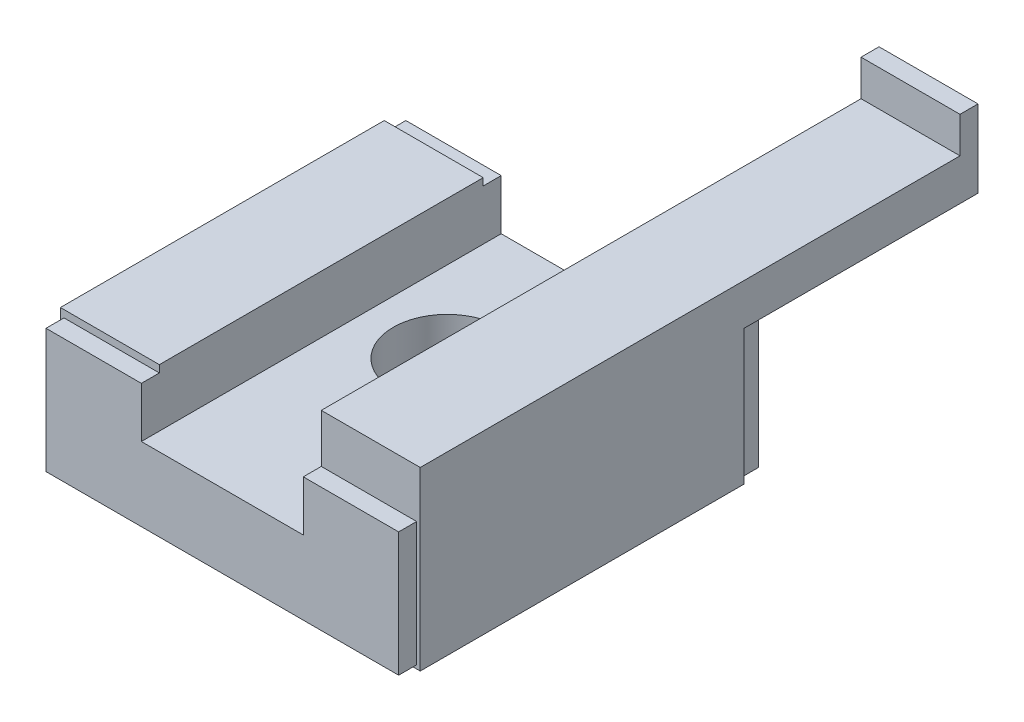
ISO-10303-21;
HEADER;
FILE_DESCRIPTION(('STEP AP214'),'2;1');
FILE_NAME('part.step','',(''),(''),'','','');
FILE_SCHEMA(('AUTOMOTIVE_DESIGN { 1 0 10303 214 1 1 1 1 }'));
ENDSEC;
DATA;
#1=APPLICATION_CONTEXT('core data for automotive mechanical design processes');
#2=APPLICATION_PROTOCOL_DEFINITION('international standard','automotive_design',2000,#1);
#3=PRODUCT_CONTEXT('',#1,'mechanical');
#4=PRODUCT('Part','Part','',(#3));
#5=PRODUCT_RELATED_PRODUCT_CATEGORY('part','',(#4));
#6=PRODUCT_DEFINITION_FORMATION('','',#4);
#7=PRODUCT_DEFINITION_CONTEXT('part definition',#1,'design');
#8=PRODUCT_DEFINITION('design','',#6,#7);
#9=PRODUCT_DEFINITION_SHAPE('','',#8);
#10=(LENGTH_UNIT() NAMED_UNIT(*) SI_UNIT(.MILLI.,.METRE.));
#11=(NAMED_UNIT(*) PLANE_ANGLE_UNIT() SI_UNIT($,.RADIAN.));
#12=(NAMED_UNIT(*) SI_UNIT($,.STERADIAN.) SOLID_ANGLE_UNIT());
#13=UNCERTAINTY_MEASURE_WITH_UNIT(LENGTH_MEASURE(1.E-05),#10,'distance_accuracy_value','');
#14=(GEOMETRIC_REPRESENTATION_CONTEXT(3) GLOBAL_UNCERTAINTY_ASSIGNED_CONTEXT((#13)) GLOBAL_UNIT_ASSIGNED_CONTEXT((#10,
#11,#12)) REPRESENTATION_CONTEXT('',''));
#15=CARTESIAN_POINT('',(0.,0.,0.));
#16=DIRECTION('',(0.,0.,1.));
#17=DIRECTION('',(1.,0.,0.));
#18=AXIS2_PLACEMENT_3D('',#15,#16,#17);
#19=CARTESIAN_POINT('',(4.5,9.8,19.));
#20=DIRECTION('',(0.,1.,0.));
#21=DIRECTION('',(1.,0.,0.));
#22=AXIS2_PLACEMENT_3D('',#19,#20,#21);
#23=PLANE('',#22);
#24=DIRECTION('',(-1.,0.,0.));
#25=VECTOR('',#24,1.);
#26=CARTESIAN_POINT('',(10.,9.8,-11.));
#27=LINE('',#26,#25);
#28=CARTESIAN_POINT('',(4.5,9.8,-11.));
#29=VERTEX_POINT('',#28);
#30=CARTESIAN_POINT('',(10.,9.8,-11.));
#31=VERTEX_POINT('',#30);
#32=EDGE_CURVE('E197',#29,#31,#27,.F.);
#33=ORIENTED_EDGE('',*,*,#32,.F.);
#34=DIRECTION('',(0.,0.,1.));
#35=VECTOR('',#34,1.);
#36=CARTESIAN_POINT('',(4.5,9.8,-11.));
#37=LINE('',#36,#35);
#38=CARTESIAN_POINT('',(4.5,9.8,19.));
#39=VERTEX_POINT('',#38);
#40=EDGE_CURVE('E212',#39,#29,#37,.F.);
#41=ORIENTED_EDGE('',*,*,#40,.F.);
#42=DIRECTION('',(1.,0.,0.));
#43=VECTOR('',#42,1.);
#44=CARTESIAN_POINT('',(4.5,9.8,19.));
#45=LINE('',#44,#43);
#46=CARTESIAN_POINT('',(10.,9.8,19.));
#47=VERTEX_POINT('',#46);
#48=EDGE_CURVE('E221',#47,#39,#45,.F.);
#49=ORIENTED_EDGE('',*,*,#48,.F.);
#50=DIRECTION('',(0.,0.,-1.));
#51=VECTOR('',#50,1.);
#52=CARTESIAN_POINT('',(10.,9.8,19.));
#53=LINE('',#52,#51);
#54=EDGE_CURVE('E214',#47,#31,#53,.T.);
#55=ORIENTED_EDGE('',*,*,#54,.T.);
#56=EDGE_LOOP('',(#33,#41,#49,#55));
#57=FACE_BOUND('',#56,.T.);
#58=ADVANCED_FACE('F16',(#57),#23,.T.);
#59=CARTESIAN_POINT('',(-10.,7.5,19.));
#60=DIRECTION('',(0.,1.,0.));
#61=DIRECTION('',(1.,0.,0.));
#62=AXIS2_PLACEMENT_3D('',#59,#60,#61);
#63=PLANE('',#62);
#64=DIRECTION('',(1.,0.,0.));
#65=VECTOR('',#64,1.);
#66=CARTESIAN_POINT('',(-10.,7.5,19.));
#67=LINE('',#66,#65);
#68=CARTESIAN_POINT('',(-4.5,7.5,19.));
#69=VERTEX_POINT('',#68);
#70=CARTESIAN_POINT('',(-10.,7.5,19.));
#71=VERTEX_POINT('',#70);
#72=EDGE_CURVE('E232',#69,#71,#67,.F.);
#73=ORIENTED_EDGE('',*,*,#72,.F.);
#74=DIRECTION('',(0.,0.,-1.));
#75=VECTOR('',#74,1.);
#76=CARTESIAN_POINT('',(-4.5,7.5,19.));
#77=LINE('',#76,#75);
#78=CARTESIAN_POINT('',(-4.5,7.5,1.));
#79=VERTEX_POINT('',#78);
#80=EDGE_CURVE('E236',#69,#79,#77,.T.);
#81=ORIENTED_EDGE('',*,*,#80,.T.);
#82=DIRECTION('',(-1.,0.,0.));
#83=VECTOR('',#82,1.);
#84=CARTESIAN_POINT('',(-4.5,7.5,1.));
#85=LINE('',#84,#83);
#86=CARTESIAN_POINT('',(-10.,7.5,1.));
#87=VERTEX_POINT('',#86);
#88=EDGE_CURVE('E241',#79,#87,#85,.T.);
#89=ORIENTED_EDGE('',*,*,#88,.T.);
#90=DIRECTION('',(0.,0.,1.));
#91=VECTOR('',#90,1.);
#92=CARTESIAN_POINT('',(-10.,7.5,1.));
#93=LINE('',#92,#91);
#94=EDGE_CURVE('E246',#71,#87,#93,.F.);
#95=ORIENTED_EDGE('',*,*,#94,.F.);
#96=EDGE_LOOP('',(#73,#81,#89,#95));
#97=FACE_BOUND('',#96,.T.);
#98=ADVANCED_FACE('F620',(#97),#63,.T.);
#99=CARTESIAN_POINT('',(-10.,0.,19.));
#100=DIRECTION('',(-1.,0.,0.));
#101=DIRECTION('',(0.,1.,0.));
#102=AXIS2_PLACEMENT_3D('',#99,#100,#101);
#103=PLANE('',#102);
#104=DIRECTION('',(0.,1.,0.));
#105=VECTOR('',#104,1.);
#106=CARTESIAN_POINT('',(-10.,0.,19.));
#107=LINE('',#106,#105);
#108=CARTESIAN_POINT('',(-10.,0.,19.));
#109=VERTEX_POINT('',#108);
#110=EDGE_CURVE('E251',#71,#109,#107,.F.);
#111=ORIENTED_EDGE('',*,*,#110,.F.);
#112=ORIENTED_EDGE('',*,*,#94,.T.);
#113=DIRECTION('',(0.,-1.,0.));
#114=VECTOR('',#113,1.);
#115=CARTESIAN_POINT('',(-10.,7.5,1.));
#116=LINE('',#115,#114);
#117=CARTESIAN_POINT('',(-10.,0.,1.));
#118=VERTEX_POINT('',#117);
#119=EDGE_CURVE('E255',#87,#118,#116,.T.);
#120=ORIENTED_EDGE('',*,*,#119,.T.);
#121=DIRECTION('',(0.,0.,1.));
#122=VECTOR('',#121,1.);
#123=CARTESIAN_POINT('',(-10.,0.,1.));
#124=LINE('',#123,#122);
#125=EDGE_CURVE('E260',#109,#118,#124,.F.);
#126=ORIENTED_EDGE('',*,*,#125,.F.);
#127=EDGE_LOOP('',(#111,#112,#120,#126));
#128=FACE_BOUND('',#127,.T.);
#129=ADVANCED_FACE('F625',(#128),#103,.T.);
#130=CARTESIAN_POINT('',(-10.,0.,1.));
#131=DIRECTION('',(0.,-1.,0.));
#132=DIRECTION('',(1.,0.,0.));
#133=AXIS2_PLACEMENT_3D('',#130,#131,#132);
#134=PLANE('',#133);
#135=DIRECTION('',(-1.,0.,0.));
#136=VECTOR('',#135,1.);
#137=CARTESIAN_POINT('',(-4.,0.,19.));
#138=LINE('',#137,#136);
#139=CARTESIAN_POINT('',(-4.,0.,19.));
#140=VERTEX_POINT('',#139);
#141=EDGE_CURVE('E265',#109,#140,#138,.F.);
#142=ORIENTED_EDGE('',*,*,#141,.F.);
#143=ORIENTED_EDGE('',*,*,#125,.T.);
#144=DIRECTION('',(1.,0.,0.));
#145=VECTOR('',#144,1.);
#146=CARTESIAN_POINT('',(-10.,0.,1.));
#147=LINE('',#146,#145);
#148=CARTESIAN_POINT('',(-4.,0.,1.));
#149=VERTEX_POINT('',#148);
#150=EDGE_CURVE('E269',#118,#149,#147,.T.);
#151=ORIENTED_EDGE('',*,*,#150,.T.);
#152=DIRECTION('',(0.,0.,1.));
#153=VECTOR('',#152,1.);
#154=CARTESIAN_POINT('',(-4.,0.,1.));
#155=LINE('',#154,#153);
#156=EDGE_CURVE('E274',#140,#149,#155,.F.);
#157=ORIENTED_EDGE('',*,*,#156,.F.);
#158=EDGE_LOOP('',(#142,#143,#151,#157));
#159=FACE_BOUND('',#158,.T.);
#160=CARTESIAN_POINT('',(-7.5,0.,10.));
#161=DIRECTION('',(0.,1.,0.));
#162=DIRECTION('',(0.,0.,-1.));
#163=AXIS2_PLACEMENT_3D('',#160,#161,#162);
#164=CIRCLE('',#163,1.5);
#165=CARTESIAN_POINT('',(-7.5,0.,8.5));
#166=VERTEX_POINT('',#165);
#167=EDGE_CURVE('E279',#166,#166,#164,.F.);
#168=ORIENTED_EDGE('',*,*,#167,.F.);
#169=EDGE_LOOP('',(#168));
#170=FACE_BOUND('',#169,.T.);
#171=ADVANCED_FACE('F631',(#159,#170),#134,.T.);
#172=CARTESIAN_POINT('',(-3.8,0.200000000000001,1.));
#173=DIRECTION('',(0.707106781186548,-0.707106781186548,0.));
#174=DIRECTION('',(0.,0.,1.));
#175=AXIS2_PLACEMENT_3D('',#172,#173,#174);
#176=PLANE('',#175);
#177=DIRECTION('',(-0.707106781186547,-0.707106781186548,0.));
#178=VECTOR('',#177,1.);
#179=CARTESIAN_POINT('',(-3.8,0.200000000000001,19.));
#180=LINE('',#179,#178);
#181=CARTESIAN_POINT('',(-3.8,0.200000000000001,19.));
#182=VERTEX_POINT('',#181);
#183=EDGE_CURVE('E284',#140,#182,#180,.F.);
#184=ORIENTED_EDGE('',*,*,#183,.F.);
#185=ORIENTED_EDGE('',*,*,#156,.T.);
#186=DIRECTION('',(0.707106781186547,0.707106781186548,0.));
#187=VECTOR('',#186,1.);
#188=CARTESIAN_POINT('',(-4.,0.,1.));
#189=LINE('',#188,#187);
#190=CARTESIAN_POINT('',(-3.8,0.200000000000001,1.));
#191=VERTEX_POINT('',#190);
#192=EDGE_CURVE('E286',#149,#191,#189,.T.);
#193=ORIENTED_EDGE('',*,*,#192,.T.);
#194=DIRECTION('',(0.,0.,1.));
#195=VECTOR('',#194,1.);
#196=CARTESIAN_POINT('',(-3.8,0.200000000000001,1.));
#197=LINE('',#196,#195);
#198=EDGE_CURVE('E291',#182,#191,#197,.F.);
#199=ORIENTED_EDGE('',*,*,#198,.F.);
#200=EDGE_LOOP('',(#184,#185,#193,#199));
#201=FACE_BOUND('',#200,.T.);
#202=ADVANCED_FACE('F635',(#201),#176,.T.);
#203=CARTESIAN_POINT('',(4.,0.,1.));
#204=DIRECTION('',(-0.707106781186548,-0.707106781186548,0.));
#205=DIRECTION('',(0.,0.,1.));
#206=AXIS2_PLACEMENT_3D('',#203,#204,#205);
#207=PLANE('',#206);
#208=DIRECTION('',(-0.707106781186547,0.707106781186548,0.));
#209=VECTOR('',#208,1.);
#210=CARTESIAN_POINT('',(4.,0.,19.));
#211=LINE('',#210,#209);
#212=CARTESIAN_POINT('',(3.8,0.2,19.));
#213=VERTEX_POINT('',#212);
#214=CARTESIAN_POINT('',(4.,0.,19.));
#215=VERTEX_POINT('',#214);
#216=EDGE_CURVE('E296',#213,#215,#211,.F.);
#217=ORIENTED_EDGE('',*,*,#216,.F.);
#218=DIRECTION('',(0.,0.,-1.));
#219=VECTOR('',#218,1.);
#220=CARTESIAN_POINT('',(3.8,0.2,19.));
#221=LINE('',#220,#219);
#222=CARTESIAN_POINT('',(3.8,0.2,1.));
#223=VERTEX_POINT('',#222);
#224=EDGE_CURVE('E300',#213,#223,#221,.T.);
#225=ORIENTED_EDGE('',*,*,#224,.T.);
#226=DIRECTION('',(0.707106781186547,-0.707106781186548,0.));
#227=VECTOR('',#226,1.);
#228=CARTESIAN_POINT('',(3.8,0.2,1.));
#229=LINE('',#228,#227);
#230=CARTESIAN_POINT('',(4.,0.,1.));
#231=VERTEX_POINT('',#230);
#232=EDGE_CURVE('E305',#223,#231,#229,.T.);
#233=ORIENTED_EDGE('',*,*,#232,.T.);
#234=DIRECTION('',(0.,0.,1.));
#235=VECTOR('',#234,1.);
#236=CARTESIAN_POINT('',(4.,0.,1.));
#237=LINE('',#236,#235);
#238=EDGE_CURVE('E310',#215,#231,#237,.F.);
#239=ORIENTED_EDGE('',*,*,#238,.F.);
#240=EDGE_LOOP('',(#217,#225,#233,#239));
#241=FACE_BOUND('',#240,.T.);
#242=ADVANCED_FACE('F639',(#241),#207,.T.);
#243=CARTESIAN_POINT('',(4.,0.,1.));
#244=DIRECTION('',(0.,-1.,0.));
#245=DIRECTION('',(1.,0.,0.));
#246=AXIS2_PLACEMENT_3D('',#243,#244,#245);
#247=PLANE('',#246);
#248=DIRECTION('',(-1.,0.,0.));
#249=VECTOR('',#248,1.);
#250=CARTESIAN_POINT('',(10.,0.,19.));
#251=LINE('',#250,#249);
#252=CARTESIAN_POINT('',(10.,0.,19.));
#253=VERTEX_POINT('',#252);
#254=EDGE_CURVE('E315',#215,#253,#251,.F.);
#255=ORIENTED_EDGE('',*,*,#254,.F.);
#256=ORIENTED_EDGE('',*,*,#238,.T.);
#257=DIRECTION('',(1.,0.,0.));
#258=VECTOR('',#257,1.);
#259=CARTESIAN_POINT('',(4.,0.,1.));
#260=LINE('',#259,#258);
#261=CARTESIAN_POINT('',(10.,0.,1.));
#262=VERTEX_POINT('',#261);
#263=EDGE_CURVE('E319',#231,#262,#260,.T.);
#264=ORIENTED_EDGE('',*,*,#263,.T.);
#265=DIRECTION('',(0.,0.,1.));
#266=VECTOR('',#265,1.);
#267=CARTESIAN_POINT('',(10.,0.,1.));
#268=LINE('',#267,#266);
#269=EDGE_CURVE('E324',#253,#262,#268,.F.);
#270=ORIENTED_EDGE('',*,*,#269,.F.);
#271=EDGE_LOOP('',(#255,#256,#264,#270));
#272=FACE_BOUND('',#271,.T.);
#273=CARTESIAN_POINT('',(7.5,0.,10.));
#274=DIRECTION('',(0.,1.,0.));
#275=DIRECTION('',(0.,0.,-1.));
#276=AXIS2_PLACEMENT_3D('',#273,#274,#275);
#277=CIRCLE('',#276,1.5);
#278=CARTESIAN_POINT('',(7.5,0.,8.5));
#279=VERTEX_POINT('',#278);
#280=EDGE_CURVE('E329',#279,#279,#277,.F.);
#281=ORIENTED_EDGE('',*,*,#280,.F.);
#282=EDGE_LOOP('',(#281));
#283=FACE_BOUND('',#282,.T.);
#284=ADVANCED_FACE('F643',(#272,#283),#247,.T.);
#285=CARTESIAN_POINT('',(10.,0.,-12.));
#286=DIRECTION('',(1.,0.,0.));
#287=DIRECTION('',(0.,1.,0.));
#288=AXIS2_PLACEMENT_3D('',#285,#286,#287);
#289=PLANE('',#288);
#290=DIRECTION('',(0.,-1.,0.));
#291=VECTOR('',#290,1.);
#292=CARTESIAN_POINT('',(10.,9.8,19.));
#293=LINE('',#292,#291);
#294=EDGE_CURVE('E334',#253,#47,#293,.F.);
#295=ORIENTED_EDGE('',*,*,#294,.F.);
#296=ORIENTED_EDGE('',*,*,#269,.T.);
#297=DIRECTION('',(0.,1.,0.));
#298=VECTOR('',#297,1.);
#299=CARTESIAN_POINT('',(10.,0.,0.999999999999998));
#300=LINE('',#299,#298);
#301=CARTESIAN_POINT('',(10.,7.5,0.999999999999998));
#302=VERTEX_POINT('',#301);
#303=EDGE_CURVE('E336',#262,#302,#300,.T.);
#304=ORIENTED_EDGE('',*,*,#303,.T.);
#305=DIRECTION('',(0.,0.,-1.));
#306=VECTOR('',#305,1.);
#307=CARTESIAN_POINT('',(10.,7.5,0.999999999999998));
#308=LINE('',#307,#306);
#309=CARTESIAN_POINT('',(10.,7.5,-12.));
#310=VERTEX_POINT('',#309);
#311=EDGE_CURVE('E341',#310,#302,#308,.F.);
#312=ORIENTED_EDGE('',*,*,#311,.F.);
#313=DIRECTION('',(0.,1.,0.));
#314=VECTOR('',#313,1.);
#315=CARTESIAN_POINT('',(10.,7.5,-12.));
#316=LINE('',#315,#314);
#317=CARTESIAN_POINT('',(10.,11.8,-12.));
#318=VERTEX_POINT('',#317);
#319=EDGE_CURVE('E345',#310,#318,#316,.T.);
#320=ORIENTED_EDGE('',*,*,#319,.T.);
#321=DIRECTION('',(0.,0.,1.));
#322=VECTOR('',#321,1.);
#323=CARTESIAN_POINT('',(10.,11.8,-12.));
#324=LINE('',#323,#322);
#325=CARTESIAN_POINT('',(10.,11.8,-11.));
#326=VERTEX_POINT('',#325);
#327=EDGE_CURVE('E350',#326,#318,#324,.F.);
#328=ORIENTED_EDGE('',*,*,#327,.F.);
#329=DIRECTION('',(0.,-1.,0.));
#330=VECTOR('',#329,1.);
#331=CARTESIAN_POINT('',(10.,11.8,-11.));
#332=LINE('',#331,#330);
#333=EDGE_CURVE('E354',#31,#326,#332,.F.);
#334=ORIENTED_EDGE('',*,*,#333,.F.);
#335=ORIENTED_EDGE('',*,*,#54,.F.);
#336=EDGE_LOOP('',(#295,#296,#304,#312,#320,#328,#334,#335));
#337=FACE_BOUND('',#336,.T.);
#338=ADVANCED_FACE('F647',(#337),#289,.T.);
#339=CARTESIAN_POINT('',(4.5,4.3,20.));
#340=DIRECTION('',(-1.,0.,0.));
#341=DIRECTION('',(0.,1.,0.));
#342=AXIS2_PLACEMENT_3D('',#339,#340,#341);
#343=PLANE('',#342);
#344=DIRECTION('',(0.,1.,0.));
#345=VECTOR('',#344,1.);
#346=CARTESIAN_POINT('',(4.5,4.3,20.));
#347=LINE('',#346,#345);
#348=CARTESIAN_POINT('',(4.5,7.1,20.));
#349=VERTEX_POINT('',#348);
#350=CARTESIAN_POINT('',(4.5,4.3,20.));
#351=VERTEX_POINT('',#350);
#352=EDGE_CURVE('E358',#349,#351,#347,.F.);
#353=ORIENTED_EDGE('',*,*,#352,.F.);
#354=DIRECTION('',(0.,0.,-1.));
#355=VECTOR('',#354,1.);
#356=CARTESIAN_POINT('',(4.5,7.1,20.));
#357=LINE('',#356,#355);
#358=CARTESIAN_POINT('',(4.5,7.1,19.));
#359=VERTEX_POINT('',#358);
#360=EDGE_CURVE('E362',#359,#349,#357,.F.);
#361=ORIENTED_EDGE('',*,*,#360,.F.);
#362=DIRECTION('',(0.,1.,0.));
#363=VECTOR('',#362,1.);
#364=CARTESIAN_POINT('',(4.5,7.1,19.));
#365=LINE('',#364,#363);
#366=EDGE_CURVE('E206',#39,#359,#365,.F.);
#367=ORIENTED_EDGE('',*,*,#366,.F.);
#368=ORIENTED_EDGE('',*,*,#40,.T.);
#369=DIRECTION('',(0.,1.,0.));
#370=VECTOR('',#369,1.);
#371=CARTESIAN_POINT('',(4.5,9.8,-11.));
#372=LINE('',#371,#370);
#373=CARTESIAN_POINT('',(4.5,11.8,-11.));
#374=VERTEX_POINT('',#373);
#375=EDGE_CURVE('E194',#374,#29,#372,.F.);
#376=ORIENTED_EDGE('',*,*,#375,.F.);
#377=DIRECTION('',(0.,0.,-1.));
#378=VECTOR('',#377,1.);
#379=CARTESIAN_POINT('',(4.5,11.8,-11.));
#380=LINE('',#379,#378);
#381=CARTESIAN_POINT('',(4.5,11.8,-12.));
#382=VERTEX_POINT('',#381);
#383=EDGE_CURVE('E205',#374,#382,#380,.T.);
#384=ORIENTED_EDGE('',*,*,#383,.T.);
#385=DIRECTION('',(0.,-1.,0.));
#386=VECTOR('',#385,1.);
#387=CARTESIAN_POINT('',(4.5,11.8,-12.));
#388=LINE('',#387,#386);
#389=CARTESIAN_POINT('',(4.5,7.5,-12.));
#390=VERTEX_POINT('',#389);
#391=EDGE_CURVE('E374',#382,#390,#388,.T.);
#392=ORIENTED_EDGE('',*,*,#391,.T.);
#393=DIRECTION('',(0.,0.,1.));
#394=VECTOR('',#393,1.);
#395=CARTESIAN_POINT('',(4.5,7.5,-12.));
#396=LINE('',#395,#394);
#397=CARTESIAN_POINT('',(4.5,7.5,0.));
#398=VERTEX_POINT('',#397);
#399=EDGE_CURVE('E379',#390,#398,#396,.T.);
#400=ORIENTED_EDGE('',*,*,#399,.T.);
#401=DIRECTION('',(0.,-1.,0.));
#402=VECTOR('',#401,1.);
#403=CARTESIAN_POINT('',(4.5,7.5,0.));
#404=LINE('',#403,#402);
#405=CARTESIAN_POINT('',(4.5,4.3,0.));
#406=VERTEX_POINT('',#405);
#407=EDGE_CURVE('E384',#398,#406,#404,.T.);
#408=ORIENTED_EDGE('',*,*,#407,.T.);
#409=DIRECTION('',(0.,0.,1.));
#410=VECTOR('',#409,1.);
#411=CARTESIAN_POINT('',(4.5,4.3,0.));
#412=LINE('',#411,#410);
#413=EDGE_CURVE('E389',#351,#406,#412,.F.);
#414=ORIENTED_EDGE('',*,*,#413,.F.);
#415=EDGE_LOOP('',(#353,#361,#367,#368,#376,#384,#392,#400,#408,#414));
#416=FACE_BOUND('',#415,.T.);
#417=ADVANCED_FACE('F218',(#416),#343,.T.);
#418=CARTESIAN_POINT('',(-4.5,4.3,0.));
#419=DIRECTION('',(1.,0.,0.));
#420=DIRECTION('',(0.,1.,0.));
#421=AXIS2_PLACEMENT_3D('',#418,#419,#420);
#422=PLANE('',#421);
#423=DIRECTION('',(0.,-1.,0.));
#424=VECTOR('',#423,1.);
#425=CARTESIAN_POINT('',(-4.5,7.5,19.));
#426=LINE('',#425,#424);
#427=CARTESIAN_POINT('',(-4.5,7.1,19.));
#428=VERTEX_POINT('',#427);
#429=EDGE_CURVE('E393',#428,#69,#426,.F.);
#430=ORIENTED_EDGE('',*,*,#429,.F.);
#431=DIRECTION('',(0.,0.,1.));
#432=VECTOR('',#431,1.);
#433=CARTESIAN_POINT('',(-4.5,7.1,19.));
#434=LINE('',#433,#432);
#435=CARTESIAN_POINT('',(-4.5,7.1,20.));
#436=VERTEX_POINT('',#435);
#437=EDGE_CURVE('E397',#428,#436,#434,.T.);
#438=ORIENTED_EDGE('',*,*,#437,.T.);
#439=DIRECTION('',(0.,-1.,0.));
#440=VECTOR('',#439,1.);
#441=CARTESIAN_POINT('',(-4.5,7.1,20.));
#442=LINE('',#441,#440);
#443=CARTESIAN_POINT('',(-4.5,4.3,20.));
#444=VERTEX_POINT('',#443);
#445=EDGE_CURVE('E402',#444,#436,#442,.F.);
#446=ORIENTED_EDGE('',*,*,#445,.F.);
#447=DIRECTION('',(0.,0.,-1.));
#448=VECTOR('',#447,1.);
#449=CARTESIAN_POINT('',(-4.5,4.3,20.));
#450=LINE('',#449,#448);
#451=CARTESIAN_POINT('',(-4.5,4.3,0.));
#452=VERTEX_POINT('',#451);
#453=EDGE_CURVE('E407',#444,#452,#450,.T.);
#454=ORIENTED_EDGE('',*,*,#453,.T.);
#455=DIRECTION('',(0.,1.,0.));
#456=VECTOR('',#455,1.);
#457=CARTESIAN_POINT('',(-4.5,4.3,0.));
#458=LINE('',#457,#456);
#459=CARTESIAN_POINT('',(-4.5,7.1,0.));
#460=VERTEX_POINT('',#459);
#461=EDGE_CURVE('E412',#452,#460,#458,.T.);
#462=ORIENTED_EDGE('',*,*,#461,.T.);
#463=DIRECTION('',(0.,0.,1.));
#464=VECTOR('',#463,1.);
#465=CARTESIAN_POINT('',(-4.5,7.1,0.));
#466=LINE('',#465,#464);
#467=CARTESIAN_POINT('',(-4.5,7.1,1.));
#468=VERTEX_POINT('',#467);
#469=EDGE_CURVE('E417',#468,#460,#466,.F.);
#470=ORIENTED_EDGE('',*,*,#469,.F.);
#471=DIRECTION('',(0.,1.,0.));
#472=VECTOR('',#471,1.);
#473=CARTESIAN_POINT('',(-4.5,7.1,1.));
#474=LINE('',#473,#472);
#475=EDGE_CURVE('E421',#468,#79,#474,.T.);
#476=ORIENTED_EDGE('',*,*,#475,.T.);
#477=ORIENTED_EDGE('',*,*,#80,.F.);
#478=EDGE_LOOP('',(#430,#438,#446,#454,#462,#470,#476,#477));
#479=FACE_BOUND('',#478,.T.);
#480=ADVANCED_FACE('F654',(#479),#422,.T.);
#481=CARTESIAN_POINT('',(-9.8,0.2,0.));
#482=DIRECTION('',(0.,0.,-1.));
#483=DIRECTION('',(0.,1.,0.));
#484=AXIS2_PLACEMENT_3D('',#481,#482,#483);
#485=PLANE('',#484);
#486=DIRECTION('',(1.,0.,0.));
#487=VECTOR('',#486,1.);
#488=CARTESIAN_POINT('',(4.5,7.5,0.));
#489=LINE('',#488,#487);
#490=CARTESIAN_POINT('',(9.8,7.5,0.));
#491=VERTEX_POINT('',#490);
#492=EDGE_CURVE('E426',#398,#491,#489,.T.);
#493=ORIENTED_EDGE('',*,*,#492,.T.);
#494=DIRECTION('',(0.,-1.,0.));
#495=VECTOR('',#494,1.);
#496=CARTESIAN_POINT('',(9.8,7.5,0.));
#497=LINE('',#496,#495);
#498=CARTESIAN_POINT('',(9.8,0.2,0.));
#499=VERTEX_POINT('',#498);
#500=EDGE_CURVE('E431',#491,#499,#497,.T.);
#501=ORIENTED_EDGE('',*,*,#500,.T.);
#502=DIRECTION('',(-1.,0.,0.));
#503=VECTOR('',#502,1.);
#504=CARTESIAN_POINT('',(9.79999999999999,0.2,0.));
#505=LINE('',#504,#503);
#506=CARTESIAN_POINT('',(-9.8,0.2,0.));
#507=VERTEX_POINT('',#506);
#508=EDGE_CURVE('E436',#507,#499,#505,.F.);
#509=ORIENTED_EDGE('',*,*,#508,.F.);
#510=DIRECTION('',(0.,1.,0.));
#511=VECTOR('',#510,1.);
#512=CARTESIAN_POINT('',(-9.8,0.2,0.));
#513=LINE('',#512,#511);
#514=CARTESIAN_POINT('',(-9.8,7.1,0.));
#515=VERTEX_POINT('',#514);
#516=EDGE_CURVE('E441',#507,#515,#513,.T.);
#517=ORIENTED_EDGE('',*,*,#516,.T.);
#518=DIRECTION('',(1.,0.,0.));
#519=VECTOR('',#518,1.);
#520=CARTESIAN_POINT('',(-9.8,7.1,0.));
#521=LINE('',#520,#519);
#522=EDGE_CURVE('E446',#515,#460,#521,.T.);
#523=ORIENTED_EDGE('',*,*,#522,.T.);
#524=ORIENTED_EDGE('',*,*,#461,.F.);
#525=DIRECTION('',(1.,0.,0.));
#526=VECTOR('',#525,1.);
#527=CARTESIAN_POINT('',(-4.5,4.3,0.));
#528=LINE('',#527,#526);
#529=EDGE_CURVE('E451',#406,#452,#528,.F.);
#530=ORIENTED_EDGE('',*,*,#529,.F.);
#531=ORIENTED_EDGE('',*,*,#407,.F.);
#532=EDGE_LOOP('',(#493,#501,#509,#517,#523,#524,#530,#531));
#533=FACE_BOUND('',#532,.T.);
#534=ADVANCED_FACE('F657',(#533),#485,.T.);
#535=CARTESIAN_POINT('',(-9.8,0.2,0.));
#536=DIRECTION('',(0.,-1.,0.));
#537=DIRECTION('',(1.,0.,0.));
#538=AXIS2_PLACEMENT_3D('',#535,#536,#537);
#539=PLANE('',#538);
#540=DIRECTION('',(-1.,0.,0.));
#541=VECTOR('',#540,1.);
#542=CARTESIAN_POINT('',(9.8,0.2,20.));
#543=LINE('',#542,#541);
#544=CARTESIAN_POINT('',(-9.8,0.2,20.));
#545=VERTEX_POINT('',#544);
#546=CARTESIAN_POINT('',(9.8,0.2,20.));
#547=VERTEX_POINT('',#546);
#548=EDGE_CURVE('E455',#545,#547,#543,.F.);
#549=ORIENTED_EDGE('',*,*,#548,.F.);
#550=DIRECTION('',(0.,0.,-1.));
#551=VECTOR('',#550,1.);
#552=CARTESIAN_POINT('',(-9.8,0.2,20.));
#553=LINE('',#552,#551);
#554=CARTESIAN_POINT('',(-9.8,0.2,19.));
#555=VERTEX_POINT('',#554);
#556=EDGE_CURVE('E460',#555,#545,#553,.F.);
#557=ORIENTED_EDGE('',*,*,#556,.F.);
#558=DIRECTION('',(1.,0.,0.));
#559=VECTOR('',#558,1.);
#560=CARTESIAN_POINT('',(-9.8,0.2,19.));
#561=LINE('',#560,#559);
#562=EDGE_CURVE('E464',#182,#555,#561,.F.);
#563=ORIENTED_EDGE('',*,*,#562,.F.);
#564=ORIENTED_EDGE('',*,*,#198,.T.);
#565=DIRECTION('',(-1.,0.,0.));
#566=VECTOR('',#565,1.);
#567=CARTESIAN_POINT('',(-3.8,0.2,1.));
#568=LINE('',#567,#566);
#569=CARTESIAN_POINT('',(-9.8,0.2,1.));
#570=VERTEX_POINT('',#569);
#571=EDGE_CURVE('E468',#191,#570,#568,.T.);
#572=ORIENTED_EDGE('',*,*,#571,.T.);
#573=DIRECTION('',(0.,0.,-1.));
#574=VECTOR('',#573,1.);
#575=CARTESIAN_POINT('',(-9.8,0.2,1.));
#576=LINE('',#575,#574);
#577=EDGE_CURVE('E473',#570,#507,#576,.T.);
#578=ORIENTED_EDGE('',*,*,#577,.T.);
#579=ORIENTED_EDGE('',*,*,#508,.T.);
#580=DIRECTION('',(0.,0.,1.));
#581=VECTOR('',#580,1.);
#582=CARTESIAN_POINT('',(9.8,0.2,0.));
#583=LINE('',#582,#581);
#584=CARTESIAN_POINT('',(9.8,0.2,1.));
#585=VERTEX_POINT('',#584);
#586=EDGE_CURVE('E478',#585,#499,#583,.F.);
#587=ORIENTED_EDGE('',*,*,#586,.F.);
#588=DIRECTION('',(-1.,0.,0.));
#589=VECTOR('',#588,1.);
#590=CARTESIAN_POINT('',(9.8,0.2,1.));
#591=LINE('',#590,#589);
#592=EDGE_CURVE('E482',#585,#223,#591,.T.);
#593=ORIENTED_EDGE('',*,*,#592,.T.);
#594=ORIENTED_EDGE('',*,*,#224,.F.);
#595=DIRECTION('',(1.,0.,0.));
#596=VECTOR('',#595,1.);
#597=CARTESIAN_POINT('',(3.8,0.2,19.));
#598=LINE('',#597,#596);
#599=CARTESIAN_POINT('',(9.8,0.2,19.));
#600=VERTEX_POINT('',#599);
#601=EDGE_CURVE('E487',#600,#213,#598,.F.);
#602=ORIENTED_EDGE('',*,*,#601,.F.);
#603=DIRECTION('',(0.,0.,1.));
#604=VECTOR('',#603,1.);
#605=CARTESIAN_POINT('',(9.8,0.2,19.));
#606=LINE('',#605,#604);
#607=EDGE_CURVE('E491',#600,#547,#606,.T.);
#608=ORIENTED_EDGE('',*,*,#607,.T.);
#609=EDGE_LOOP('',(#549,#557,#563,#564,#572,#578,#579,#587,#593,#594,#602,#608));
#610=FACE_BOUND('',#609,.T.);
#611=CARTESIAN_POINT('',(0.,0.2,7.5));
#612=DIRECTION('',(0.,1.,0.));
#613=DIRECTION('',(0.,0.,-1.));
#614=AXIS2_PLACEMENT_3D('',#611,#612,#613);
#615=CIRCLE('',#614,3.);
#616=CARTESIAN_POINT('',(0.,0.2,4.5));
#617=VERTEX_POINT('',#616);
#618=EDGE_CURVE('E496',#617,#617,#615,.F.);
#619=ORIENTED_EDGE('',*,*,#618,.F.);
#620=EDGE_LOOP('',(#619));
#621=FACE_BOUND('',#620,.T.);
#622=CARTESIAN_POINT('',(0.,0.2,15.));
#623=DIRECTION('',(0.,1.,0.));
#624=DIRECTION('',(-1.42053936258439E-07,0.,-0.99999999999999));
#625=AXIS2_PLACEMENT_3D('',#622,#623,#624);
#626=CIRCLE('',#625,1.25);
#627=CARTESIAN_POINT('',(-1.77567420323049E-07,0.2,13.75));
#628=VERTEX_POINT('',#627);
#629=EDGE_CURVE('E501',#628,#628,#626,.F.);
#630=ORIENTED_EDGE('',*,*,#629,.F.);
#631=EDGE_LOOP('',(#630));
#632=FACE_BOUND('',#631,.T.);
#633=ADVANCED_FACE('F661',(#610,#621,#632),#539,.T.);
#634=CARTESIAN_POINT('',(-4.5,4.3,20.));
#635=DIRECTION('',(0.,1.,0.));
#636=DIRECTION('',(1.,0.,0.));
#637=AXIS2_PLACEMENT_3D('',#634,#635,#636);
#638=PLANE('',#637);
#639=ORIENTED_EDGE('',*,*,#529,.T.);
#640=ORIENTED_EDGE('',*,*,#453,.F.);
#641=DIRECTION('',(1.,0.,0.));
#642=VECTOR('',#641,1.);
#643=CARTESIAN_POINT('',(-4.5,4.3,20.));
#644=LINE('',#643,#642);
#645=EDGE_CURVE('E504',#351,#444,#644,.F.);
#646=ORIENTED_EDGE('',*,*,#645,.F.);
#647=ORIENTED_EDGE('',*,*,#413,.T.);
#648=EDGE_LOOP('',(#639,#640,#646,#647));
#649=FACE_BOUND('',#648,.T.);
#650=CARTESIAN_POINT('',(0.,4.3,7.5));
#651=DIRECTION('',(0.,-1.,0.));
#652=DIRECTION('',(0.,0.,1.));
#653=AXIS2_PLACEMENT_3D('',#650,#651,#652);
#654=CIRCLE('',#653,3.);
#655=CARTESIAN_POINT('',(0.,4.3,10.5));
#656=VERTEX_POINT('',#655);
#657=EDGE_CURVE('E506',#656,#656,#654,.F.);
#658=ORIENTED_EDGE('',*,*,#657,.F.);
#659=EDGE_LOOP('',(#658));
#660=FACE_BOUND('',#659,.T.);
#661=ADVANCED_FACE('F665',(#649,#660),#638,.T.);
#662=CARTESIAN_POINT('',(-9.8,0.2,20.));
#663=DIRECTION('',(0.,0.,1.));
#664=DIRECTION('',(1.,0.,0.));
#665=AXIS2_PLACEMENT_3D('',#662,#663,#664);
#666=PLANE('',#665);
#667=DIRECTION('',(-1.,0.,0.));
#668=VECTOR('',#667,1.);
#669=CARTESIAN_POINT('',(9.8,7.1,20.));
#670=LINE('',#669,#668);
#671=CARTESIAN_POINT('',(9.8,7.1,20.));
#672=VERTEX_POINT('',#671);
#673=EDGE_CURVE('E511',#349,#672,#670,.F.);
#674=ORIENTED_EDGE('',*,*,#673,.F.);
#675=ORIENTED_EDGE('',*,*,#352,.T.);
#676=ORIENTED_EDGE('',*,*,#645,.T.);
#677=ORIENTED_EDGE('',*,*,#445,.T.);
#678=DIRECTION('',(-1.,0.,0.));
#679=VECTOR('',#678,1.);
#680=CARTESIAN_POINT('',(-4.5,7.1,20.));
#681=LINE('',#680,#679);
#682=CARTESIAN_POINT('',(-9.8,7.1,20.));
#683=VERTEX_POINT('',#682);
#684=EDGE_CURVE('E514',#683,#436,#681,.F.);
#685=ORIENTED_EDGE('',*,*,#684,.F.);
#686=DIRECTION('',(0.,-1.,0.));
#687=VECTOR('',#686,1.);
#688=CARTESIAN_POINT('',(-9.8,7.1,20.));
#689=LINE('',#688,#687);
#690=EDGE_CURVE('E518',#545,#683,#689,.F.);
#691=ORIENTED_EDGE('',*,*,#690,.F.);
#692=ORIENTED_EDGE('',*,*,#548,.T.);
#693=DIRECTION('',(0.,1.,0.));
#694=VECTOR('',#693,1.);
#695=CARTESIAN_POINT('',(9.8,0.2,20.));
#696=LINE('',#695,#694);
#697=EDGE_CURVE('E522',#672,#547,#696,.F.);
#698=ORIENTED_EDGE('',*,*,#697,.F.);
#699=EDGE_LOOP('',(#674,#675,#676,#677,#685,#691,#692,#698));
#700=FACE_BOUND('',#699,.T.);
#701=ADVANCED_FACE('F669',(#700),#666,.T.);
#702=CARTESIAN_POINT('',(-9.8,7.1,0.));
#703=DIRECTION('',(0.,1.,0.));
#704=DIRECTION('',(0.,0.,1.));
#705=AXIS2_PLACEMENT_3D('',#702,#703,#704);
#706=PLANE('',#705);
#707=ORIENTED_EDGE('',*,*,#522,.F.);
#708=DIRECTION('',(0.,0.,1.));
#709=VECTOR('',#708,1.);
#710=CARTESIAN_POINT('',(-9.8,7.1,0.));
#711=LINE('',#710,#709);
#712=CARTESIAN_POINT('',(-9.8,7.1,1.));
#713=VERTEX_POINT('',#712);
#714=EDGE_CURVE('E526',#713,#515,#711,.F.);
#715=ORIENTED_EDGE('',*,*,#714,.F.);
#716=DIRECTION('',(1.,0.,0.));
#717=VECTOR('',#716,1.);
#718=CARTESIAN_POINT('',(-9.8,7.1,1.));
#719=LINE('',#718,#717);
#720=EDGE_CURVE('E530',#713,#468,#719,.T.);
#721=ORIENTED_EDGE('',*,*,#720,.T.);
#722=ORIENTED_EDGE('',*,*,#469,.T.);
#723=EDGE_LOOP('',(#707,#715,#721,#722));
#724=FACE_BOUND('',#723,.T.);
#725=ADVANCED_FACE('F673',(#724),#706,.T.);
#726=CARTESIAN_POINT('',(-9.8,0.2,0.));
#727=DIRECTION('',(-1.,0.,0.));
#728=DIRECTION('',(0.,0.,1.));
#729=AXIS2_PLACEMENT_3D('',#726,#727,#728);
#730=PLANE('',#729);
#731=ORIENTED_EDGE('',*,*,#516,.F.);
#732=ORIENTED_EDGE('',*,*,#577,.F.);
#733=DIRECTION('',(0.,1.,0.));
#734=VECTOR('',#733,1.);
#735=CARTESIAN_POINT('',(-9.8,0.2,1.));
#736=LINE('',#735,#734);
#737=EDGE_CURVE('E535',#570,#713,#736,.T.);
#738=ORIENTED_EDGE('',*,*,#737,.T.);
#739=ORIENTED_EDGE('',*,*,#714,.T.);
#740=EDGE_LOOP('',(#731,#732,#738,#739));
#741=FACE_BOUND('',#740,.T.);
#742=ADVANCED_FACE('F677',(#741),#730,.T.);
#743=CARTESIAN_POINT('',(-10.,0.,1.));
#744=DIRECTION('',(0.,0.,-1.));
#745=DIRECTION('',(0.,1.,0.));
#746=AXIS2_PLACEMENT_3D('',#743,#744,#745);
#747=PLANE('',#746);
#748=ORIENTED_EDGE('',*,*,#150,.F.);
#749=ORIENTED_EDGE('',*,*,#119,.F.);
#750=ORIENTED_EDGE('',*,*,#88,.F.);
#751=ORIENTED_EDGE('',*,*,#475,.F.);
#752=ORIENTED_EDGE('',*,*,#720,.F.);
#753=ORIENTED_EDGE('',*,*,#737,.F.);
#754=ORIENTED_EDGE('',*,*,#571,.F.);
#755=ORIENTED_EDGE('',*,*,#192,.F.);
#756=EDGE_LOOP('',(#748,#749,#750,#751,#752,#753,#754,#755));
#757=FACE_BOUND('',#756,.T.);
#758=ADVANCED_FACE('F681',(#757),#747,.T.);
#759=CARTESIAN_POINT('',(3.8,0.,1.));
#760=DIRECTION('',(0.,0.,-1.));
#761=DIRECTION('',(0.,1.,0.));
#762=AXIS2_PLACEMENT_3D('',#759,#760,#761);
#763=PLANE('',#762);
#764=DIRECTION('',(0.,1.,0.));
#765=VECTOR('',#764,1.);
#766=CARTESIAN_POINT('',(9.8,0.2,1.));
#767=LINE('',#766,#765);
#768=CARTESIAN_POINT('',(9.8,7.5,1.));
#769=VERTEX_POINT('',#768);
#770=EDGE_CURVE('E540',#769,#585,#767,.F.);
#771=ORIENTED_EDGE('',*,*,#770,.F.);
#772=DIRECTION('',(1.,0.,0.));
#773=VECTOR('',#772,1.);
#774=CARTESIAN_POINT('',(9.8,7.5,1.));
#775=LINE('',#774,#773);
#776=EDGE_CURVE('E544',#769,#302,#775,.T.);
#777=ORIENTED_EDGE('',*,*,#776,.T.);
#778=ORIENTED_EDGE('',*,*,#303,.F.);
#779=ORIENTED_EDGE('',*,*,#263,.F.);
#780=ORIENTED_EDGE('',*,*,#232,.F.);
#781=ORIENTED_EDGE('',*,*,#592,.F.);
#782=EDGE_LOOP('',(#771,#777,#778,#779,#780,#781));
#783=FACE_BOUND('',#782,.T.);
#784=ADVANCED_FACE('F685',(#783),#763,.T.);
#785=CARTESIAN_POINT('',(9.8,0.2,1.));
#786=DIRECTION('',(1.,0.,0.));
#787=DIRECTION('',(0.,0.,-1.));
#788=AXIS2_PLACEMENT_3D('',#785,#786,#787);
#789=PLANE('',#788);
#790=ORIENTED_EDGE('',*,*,#500,.F.);
#791=DIRECTION('',(0.,0.,1.));
#792=VECTOR('',#791,1.);
#793=CARTESIAN_POINT('',(9.8,7.5,0.));
#794=LINE('',#793,#792);
#795=EDGE_CURVE('E549',#769,#491,#794,.F.);
#796=ORIENTED_EDGE('',*,*,#795,.F.);
#797=ORIENTED_EDGE('',*,*,#770,.T.);
#798=ORIENTED_EDGE('',*,*,#586,.T.);
#799=EDGE_LOOP('',(#790,#796,#797,#798));
#800=FACE_BOUND('',#799,.T.);
#801=ADVANCED_FACE('F689',(#800),#789,.T.);
#802=CARTESIAN_POINT('',(-9.8,7.1,20.));
#803=DIRECTION('',(0.,1.,0.));
#804=DIRECTION('',(1.,0.,0.));
#805=AXIS2_PLACEMENT_3D('',#802,#803,#804);
#806=PLANE('',#805);
#807=ORIENTED_EDGE('',*,*,#684,.T.);
#808=ORIENTED_EDGE('',*,*,#437,.F.);
#809=DIRECTION('',(-1.,0.,0.));
#810=VECTOR('',#809,1.);
#811=CARTESIAN_POINT('',(-4.5,7.1,19.));
#812=LINE('',#811,#810);
#813=CARTESIAN_POINT('',(-9.8,7.1,19.));
#814=VERTEX_POINT('',#813);
#815=EDGE_CURVE('E553',#814,#428,#812,.F.);
#816=ORIENTED_EDGE('',*,*,#815,.F.);
#817=DIRECTION('',(0.,0.,1.));
#818=VECTOR('',#817,1.);
#819=CARTESIAN_POINT('',(-9.8,7.1,19.));
#820=LINE('',#819,#818);
#821=EDGE_CURVE('E557',#814,#683,#820,.T.);
#822=ORIENTED_EDGE('',*,*,#821,.T.);
#823=EDGE_LOOP('',(#807,#808,#816,#822));
#824=FACE_BOUND('',#823,.T.);
#825=ADVANCED_FACE('F693',(#824),#806,.T.);
#826=CARTESIAN_POINT('',(-9.8,0.2,20.));
#827=DIRECTION('',(-1.,0.,0.));
#828=DIRECTION('',(0.,1.,0.));
#829=AXIS2_PLACEMENT_3D('',#826,#827,#828);
#830=PLANE('',#829);
#831=ORIENTED_EDGE('',*,*,#690,.T.);
#832=ORIENTED_EDGE('',*,*,#821,.F.);
#833=DIRECTION('',(0.,-1.,0.));
#834=VECTOR('',#833,1.);
#835=CARTESIAN_POINT('',(-9.8,7.1,19.));
#836=LINE('',#835,#834);
#837=EDGE_CURVE('E39',#555,#814,#836,.F.);
#838=ORIENTED_EDGE('',*,*,#837,.F.);
#839=ORIENTED_EDGE('',*,*,#556,.T.);
#840=EDGE_LOOP('',(#831,#832,#838,#839));
#841=FACE_BOUND('',#840,.T.);
#842=ADVANCED_FACE('F697',(#841),#830,.T.);
#843=CARTESIAN_POINT('',(-10.,0.,19.));
#844=DIRECTION('',(0.,0.,1.));
#845=DIRECTION('',(1.,0.,0.));
#846=AXIS2_PLACEMENT_3D('',#843,#844,#845);
#847=PLANE('',#846);
#848=ORIENTED_EDGE('',*,*,#183,.T.);
#849=ORIENTED_EDGE('',*,*,#562,.T.);
#850=ORIENTED_EDGE('',*,*,#837,.T.);
#851=ORIENTED_EDGE('',*,*,#815,.T.);
#852=ORIENTED_EDGE('',*,*,#429,.T.);
#853=ORIENTED_EDGE('',*,*,#72,.T.);
#854=ORIENTED_EDGE('',*,*,#110,.T.);
#855=ORIENTED_EDGE('',*,*,#141,.T.);
#856=EDGE_LOOP('',(#848,#849,#850,#851,#852,#853,#854,#855));
#857=FACE_BOUND('',#856,.T.);
#858=ADVANCED_FACE('F701',(#857),#847,.T.);
#859=CARTESIAN_POINT('',(3.8,0.,19.));
#860=DIRECTION('',(0.,0.,1.));
#861=DIRECTION('',(1.,0.,0.));
#862=AXIS2_PLACEMENT_3D('',#859,#860,#861);
#863=PLANE('',#862);
#864=ORIENTED_EDGE('',*,*,#216,.T.);
#865=ORIENTED_EDGE('',*,*,#254,.T.);
#866=ORIENTED_EDGE('',*,*,#294,.T.);
#867=ORIENTED_EDGE('',*,*,#48,.T.);
#868=ORIENTED_EDGE('',*,*,#366,.T.);
#869=DIRECTION('',(1.,0.,0.));
#870=VECTOR('',#869,1.);
#871=CARTESIAN_POINT('',(4.5,7.1,19.));
#872=LINE('',#871,#870);
#873=CARTESIAN_POINT('',(9.8,7.1,19.));
#874=VERTEX_POINT('',#873);
#875=EDGE_CURVE('E565',#359,#874,#872,.T.);
#876=ORIENTED_EDGE('',*,*,#875,.T.);
#877=DIRECTION('',(0.,-1.,0.));
#878=VECTOR('',#877,1.);
#879=CARTESIAN_POINT('',(9.8,7.1,19.));
#880=LINE('',#879,#878);
#881=EDGE_CURVE('E31',#874,#600,#880,.T.);
#882=ORIENTED_EDGE('',*,*,#881,.T.);
#883=ORIENTED_EDGE('',*,*,#601,.T.);
#884=EDGE_LOOP('',(#864,#865,#866,#867,#868,#876,#882,#883));
#885=FACE_BOUND('',#884,.T.);
#886=ADVANCED_FACE('F705',(#885),#863,.T.);
#887=CARTESIAN_POINT('',(4.5,7.1,20.));
#888=DIRECTION('',(0.,1.,0.));
#889=DIRECTION('',(1.,0.,0.));
#890=AXIS2_PLACEMENT_3D('',#887,#888,#889);
#891=PLANE('',#890);
#892=ORIENTED_EDGE('',*,*,#673,.T.);
#893=DIRECTION('',(0.,0.,-1.));
#894=VECTOR('',#893,1.);
#895=CARTESIAN_POINT('',(9.8,7.1,20.));
#896=LINE('',#895,#894);
#897=EDGE_CURVE('E573',#874,#672,#896,.F.);
#898=ORIENTED_EDGE('',*,*,#897,.F.);
#899=ORIENTED_EDGE('',*,*,#875,.F.);
#900=ORIENTED_EDGE('',*,*,#360,.T.);
#901=EDGE_LOOP('',(#892,#898,#899,#900));
#902=FACE_BOUND('',#901,.T.);
#903=ADVANCED_FACE('F708',(#902),#891,.T.);
#904=CARTESIAN_POINT('',(9.8,0.2,19.));
#905=DIRECTION('',(1.,0.,0.));
#906=DIRECTION('',(0.,1.,0.));
#907=AXIS2_PLACEMENT_3D('',#904,#905,#906);
#908=PLANE('',#907);
#909=ORIENTED_EDGE('',*,*,#697,.T.);
#910=ORIENTED_EDGE('',*,*,#607,.F.);
#911=ORIENTED_EDGE('',*,*,#881,.F.);
#912=ORIENTED_EDGE('',*,*,#897,.T.);
#913=EDGE_LOOP('',(#909,#910,#911,#912));
#914=FACE_BOUND('',#913,.T.);
#915=ADVANCED_FACE('F712',(#914),#908,.T.);
#916=CARTESIAN_POINT('',(4.5,7.5,1.));
#917=DIRECTION('',(0.,-1.,0.));
#918=DIRECTION('',(0.,0.,-1.));
#919=AXIS2_PLACEMENT_3D('',#916,#917,#918);
#920=PLANE('',#919);
#921=ORIENTED_EDGE('',*,*,#492,.F.);
#922=ORIENTED_EDGE('',*,*,#399,.F.);
#923=DIRECTION('',(1.,0.,0.));
#924=VECTOR('',#923,1.);
#925=CARTESIAN_POINT('',(4.5,7.5,-12.));
#926=LINE('',#925,#924);
#927=EDGE_CURVE('E577',#390,#310,#926,.T.);
#928=ORIENTED_EDGE('',*,*,#927,.T.);
#929=ORIENTED_EDGE('',*,*,#311,.T.);
#930=ORIENTED_EDGE('',*,*,#776,.F.);
#931=ORIENTED_EDGE('',*,*,#795,.T.);
#932=EDGE_LOOP('',(#921,#922,#928,#929,#930,#931));
#933=FACE_BOUND('',#932,.T.);
#934=ADVANCED_FACE('F716',(#933),#920,.T.);
#935=CARTESIAN_POINT('',(4.5,7.5,-12.));
#936=DIRECTION('',(0.,0.,-1.));
#937=DIRECTION('',(0.,1.,0.));
#938=AXIS2_PLACEMENT_3D('',#935,#936,#937);
#939=PLANE('',#938);
#940=ORIENTED_EDGE('',*,*,#391,.F.);
#941=DIRECTION('',(1.,0.,0.));
#942=VECTOR('',#941,1.);
#943=CARTESIAN_POINT('',(4.5,11.8,-12.));
#944=LINE('',#943,#942);
#945=EDGE_CURVE('E582',#318,#382,#944,.F.);
#946=ORIENTED_EDGE('',*,*,#945,.F.);
#947=ORIENTED_EDGE('',*,*,#319,.F.);
#948=ORIENTED_EDGE('',*,*,#927,.F.);
#949=EDGE_LOOP('',(#940,#946,#947,#948));
#950=FACE_BOUND('',#949,.T.);
#951=ADVANCED_FACE('F719',(#950),#939,.T.);
#952=CARTESIAN_POINT('',(6.25449678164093,4.,11.2295000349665));
#953=DIRECTION('',(0.,-1.,0.));
#954=DIRECTION('',(0.,0.,-1.));
#955=AXIS2_PLACEMENT_3D('',#952,#953,#954);
#956=PLANE('',#955);
#957=CARTESIAN_POINT('',(7.5,4.,10.));
#958=DIRECTION('',(0.,-1.,0.));
#959=DIRECTION('',(-1.42036475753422E-07,0.,0.99999999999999));
#960=AXIS2_PLACEMENT_3D('',#957,#958,#959);
#961=CIRCLE('',#960,1.2295);
#962=CARTESIAN_POINT('',(7.49999982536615,4.,11.2295));
#963=VERTEX_POINT('',#962);
#964=EDGE_CURVE('E586',#963,#963,#961,.T.);
#965=ORIENTED_EDGE('',*,*,#964,.T.);
#966=EDGE_LOOP('',(#965));
#967=FACE_BOUND('',#966,.T.);
#968=ADVANCED_FACE('F723',(#967),#956,.T.);
#969=CARTESIAN_POINT('',(-8.74550321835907,4.,11.2295000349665));
#970=DIRECTION('',(0.,-1.,0.));
#971=DIRECTION('',(0.,0.,-1.));
#972=AXIS2_PLACEMENT_3D('',#969,#970,#971);
#973=PLANE('',#972);
#974=CARTESIAN_POINT('',(-7.5,4.,10.));
#975=DIRECTION('',(0.,-1.,0.));
#976=DIRECTION('',(-1.42036477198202E-07,0.,0.99999999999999));
#977=AXIS2_PLACEMENT_3D('',#974,#975,#976);
#978=CIRCLE('',#977,1.2295);
#979=CARTESIAN_POINT('',(-7.50000017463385,4.,11.2295));
#980=VERTEX_POINT('',#979);
#981=EDGE_CURVE('E591',#980,#980,#978,.T.);
#982=ORIENTED_EDGE('',*,*,#981,.T.);
#983=EDGE_LOOP('',(#982));
#984=FACE_BOUND('',#983,.T.);
#985=ADVANCED_FACE('F727',(#984),#973,.T.);
#986=CARTESIAN_POINT('',(-1.26627014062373,2.7,13.7499999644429));
#987=DIRECTION('',(0.,-1.,0.));
#988=DIRECTION('',(1.,0.,0.));
#989=AXIS2_PLACEMENT_3D('',#986,#987,#988);
#990=PLANE('',#989);
#991=CARTESIAN_POINT('',(0.,2.7,15.));
#992=DIRECTION('',(0.,-1.,0.));
#993=DIRECTION('',(0.,0.,1.));
#994=AXIS2_PLACEMENT_3D('',#991,#992,#993);
#995=CIRCLE('',#994,1.25);
#996=CARTESIAN_POINT('',(0.,2.7,16.25));
#997=VERTEX_POINT('',#996);
#998=EDGE_CURVE('E594',#997,#997,#995,.F.);
#999=ORIENTED_EDGE('',*,*,#998,.F.);
#1000=EDGE_LOOP('',(#999));
#1001=FACE_BOUND('',#1000,.T.);
#1002=ADVANCED_FACE('F731',(#1001),#990,.T.);
#1003=CARTESIAN_POINT('',(4.5,11.8,-11.));
#1004=DIRECTION('',(0.,1.,0.));
#1005=DIRECTION('',(1.,0.,0.));
#1006=AXIS2_PLACEMENT_3D('',#1003,#1004,#1005);
#1007=PLANE('',#1006);
#1008=ORIENTED_EDGE('',*,*,#945,.T.);
#1009=ORIENTED_EDGE('',*,*,#383,.F.);
#1010=DIRECTION('',(1.,0.,0.));
#1011=VECTOR('',#1010,1.);
#1012=CARTESIAN_POINT('',(4.5,11.8,-11.));
#1013=LINE('',#1012,#1011);
#1014=EDGE_CURVE('E200',#326,#374,#1013,.F.);
#1015=ORIENTED_EDGE('',*,*,#1014,.F.);
#1016=ORIENTED_EDGE('',*,*,#327,.T.);
#1017=EDGE_LOOP('',(#1008,#1009,#1015,#1016));
#1018=FACE_BOUND('',#1017,.T.);
#1019=ADVANCED_FACE('F735',(#1018),#1007,.T.);
#1020=CARTESIAN_POINT('',(4.5,9.8,-11.));
#1021=DIRECTION('',(0.,0.,1.));
#1022=DIRECTION('',(1.,0.,0.));
#1023=AXIS2_PLACEMENT_3D('',#1020,#1021,#1022);
#1024=PLANE('',#1023);
#1025=ORIENTED_EDGE('',*,*,#1014,.T.);
#1026=ORIENTED_EDGE('',*,*,#375,.T.);
#1027=ORIENTED_EDGE('',*,*,#32,.T.);
#1028=ORIENTED_EDGE('',*,*,#333,.T.);
#1029=EDGE_LOOP('',(#1025,#1026,#1027,#1028));
#1030=FACE_BOUND('',#1029,.T.);
#1031=ADVANCED_FACE('F196',(#1030),#1024,.T.);
#1032=CARTESIAN_POINT('',(7.5,0.,10.));
#1033=DIRECTION('',(0.,-1.,0.));
#1034=DIRECTION('',(0.,0.,1.));
#1035=AXIS2_PLACEMENT_3D('',#1032,#1033,#1034);
#1036=CYLINDRICAL_SURFACE('',#1035,1.2295);
#1037=CARTESIAN_POINT('',(7.5,0.2705,10.));
#1038=DIRECTION('',(0.,-1.,0.));
#1039=DIRECTION('',(0.,0.,1.));
#1040=AXIS2_PLACEMENT_3D('',#1037,#1038,#1039);
#1041=CIRCLE('',#1040,1.2295);
#1042=CARTESIAN_POINT('',(7.5,0.2705,11.2295));
#1043=VERTEX_POINT('',#1042);
#1044=EDGE_CURVE('E24',#1043,#1043,#1041,.T.);
#1045=ORIENTED_EDGE('',*,*,#1044,.T.);
#1046=EDGE_LOOP('',(#1045));
#1047=FACE_BOUND('',#1046,.T.);
#1048=ORIENTED_EDGE('',*,*,#964,.F.);
#1049=EDGE_LOOP('',(#1048));
#1050=FACE_BOUND('',#1049,.T.);
#1051=ADVANCED_FACE('F602',(#1047,#1050),#1036,.F.);
#1052=CARTESIAN_POINT('',(7.5,0.,10.));
#1053=DIRECTION('',(0.,-1.,0.));
#1054=DIRECTION('',(0.,0.,1.));
#1055=AXIS2_PLACEMENT_3D('',#1052,#1053,#1054);
#1056=CONICAL_SURFACE('',#1055,1.5,0.785398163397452);
#1057=ORIENTED_EDGE('',*,*,#280,.T.);
#1058=EDGE_LOOP('',(#1057));
#1059=FACE_BOUND('',#1058,.T.);
#1060=ORIENTED_EDGE('',*,*,#1044,.F.);
#1061=EDGE_LOOP('',(#1060));
#1062=FACE_BOUND('',#1061,.T.);
#1063=ADVANCED_FACE('F605',(#1059,#1062),#1056,.F.);
#1064=CARTESIAN_POINT('',(-7.5,0.,10.));
#1065=DIRECTION('',(0.,-1.,0.));
#1066=DIRECTION('',(0.,0.,1.));
#1067=AXIS2_PLACEMENT_3D('',#1064,#1065,#1066);
#1068=CYLINDRICAL_SURFACE('',#1067,1.2295);
#1069=CARTESIAN_POINT('',(-7.5,0.2705,10.));
#1070=DIRECTION('',(0.,-1.,0.));
#1071=DIRECTION('',(0.,0.,1.));
#1072=AXIS2_PLACEMENT_3D('',#1069,#1070,#1071);
#1073=CIRCLE('',#1072,1.2295);
#1074=CARTESIAN_POINT('',(-7.5,0.2705,11.2295));
#1075=VERTEX_POINT('',#1074);
#1076=EDGE_CURVE('E10',#1075,#1075,#1073,.T.);
#1077=ORIENTED_EDGE('',*,*,#1076,.T.);
#1078=EDGE_LOOP('',(#1077));
#1079=FACE_BOUND('',#1078,.T.);
#1080=ORIENTED_EDGE('',*,*,#981,.F.);
#1081=EDGE_LOOP('',(#1080));
#1082=FACE_BOUND('',#1081,.T.);
#1083=ADVANCED_FACE('F607',(#1079,#1082),#1068,.F.);
#1084=CARTESIAN_POINT('',(-7.5,0.,10.));
#1085=DIRECTION('',(0.,-1.,0.));
#1086=DIRECTION('',(0.,0.,1.));
#1087=AXIS2_PLACEMENT_3D('',#1084,#1085,#1086);
#1088=CONICAL_SURFACE('',#1087,1.5,0.785398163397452);
#1089=ORIENTED_EDGE('',*,*,#167,.T.);
#1090=EDGE_LOOP('',(#1089));
#1091=FACE_BOUND('',#1090,.T.);
#1092=ORIENTED_EDGE('',*,*,#1076,.F.);
#1093=EDGE_LOOP('',(#1092));
#1094=FACE_BOUND('',#1093,.T.);
#1095=ADVANCED_FACE('F615',(#1091,#1094),#1088,.F.);
#1096=CARTESIAN_POINT('',(0.,2.7,15.));
#1097=DIRECTION('',(0.,-1.,0.));
#1098=DIRECTION('',(0.,0.,1.));
#1099=AXIS2_PLACEMENT_3D('',#1096,#1097,#1098);
#1100=CYLINDRICAL_SURFACE('',#1099,1.25);
#1101=ORIENTED_EDGE('',*,*,#998,.T.);
#1102=EDGE_LOOP('',(#1101));
#1103=FACE_BOUND('',#1102,.T.);
#1104=ORIENTED_EDGE('',*,*,#629,.T.);
#1105=EDGE_LOOP('',(#1104));
#1106=FACE_BOUND('',#1105,.T.);
#1107=ADVANCED_FACE('F773',(#1103,#1106),#1100,.F.);
#1108=CARTESIAN_POINT('',(0.,4.4,7.5));
#1109=DIRECTION('',(0.,-1.,0.));
#1110=DIRECTION('',(0.,0.,1.));
#1111=AXIS2_PLACEMENT_3D('',#1108,#1109,#1110);
#1112=CYLINDRICAL_SURFACE('',#1111,3.);
#1113=ORIENTED_EDGE('',*,*,#657,.T.);
#1114=EDGE_LOOP('',(#1113));
#1115=FACE_BOUND('',#1114,.T.);
#1116=ORIENTED_EDGE('',*,*,#618,.T.);
#1117=EDGE_LOOP('',(#1116));
#1118=FACE_BOUND('',#1117,.T.);
#1119=ADVANCED_FACE('F18',(#1115,#1118),#1112,.F.);
#1120=CLOSED_SHELL('',(#58,#98,#129,#171,#202,#242,#284,#338,#417,#480,#534,#633,#661,#701,#725,
#742,#758,#784,#801,#825,#842,#858,#886,#903,#915,#934,#951,#968,#985,#1002,#1019,#1031,#1051,
#1063,#1083,#1095,#1107,#1119));
#1121=MANIFOLD_SOLID_BREP('B1',#1120);
#1122=ADVANCED_BREP_SHAPE_REPRESENTATION('',(#18,#1121),#14);
#1123=SHAPE_DEFINITION_REPRESENTATION(#9,#1122);
ENDSEC;
END-ISO-10303-21;
